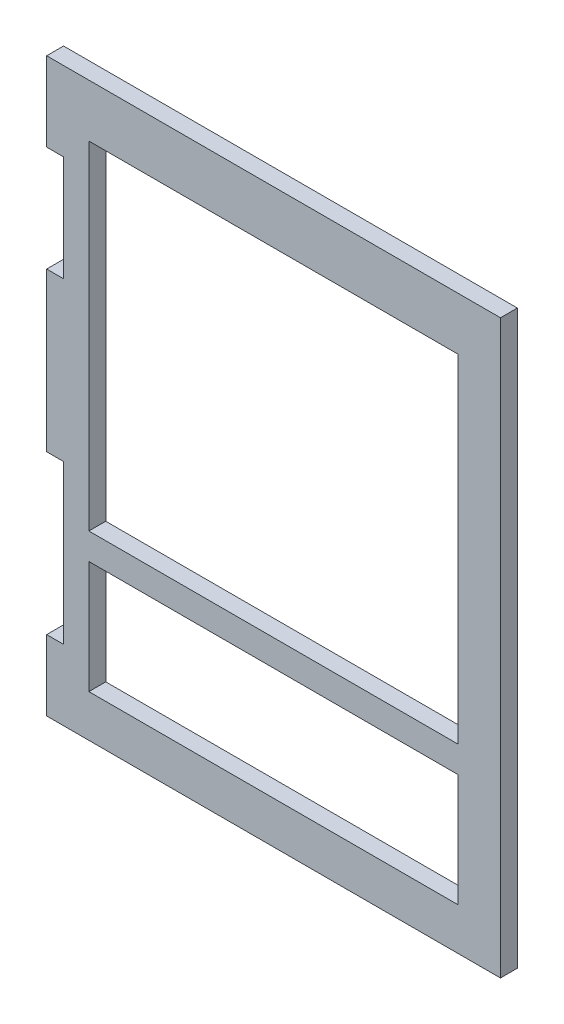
ISO-10303-21;
HEADER;
FILE_DESCRIPTION(('STEP AP214'),'2;1');
FILE_NAME('part.step','',(''),(''),'','','');
FILE_SCHEMA(('AUTOMOTIVE_DESIGN { 1 0 10303 214 1 1 1 1 }'));
ENDSEC;
DATA;
#1=APPLICATION_CONTEXT('core data for automotive mechanical design processes');
#2=APPLICATION_PROTOCOL_DEFINITION('international standard','automotive_design',2000,#1);
#3=PRODUCT_CONTEXT('',#1,'mechanical');
#4=PRODUCT('Part','Part','',(#3));
#5=PRODUCT_RELATED_PRODUCT_CATEGORY('part','',(#4));
#6=PRODUCT_DEFINITION_FORMATION('','',#4);
#7=PRODUCT_DEFINITION_CONTEXT('part definition',#1,'design');
#8=PRODUCT_DEFINITION('design','',#6,#7);
#9=PRODUCT_DEFINITION_SHAPE('','',#8);
#10=(LENGTH_UNIT() NAMED_UNIT(*) SI_UNIT(.MILLI.,.METRE.));
#11=(NAMED_UNIT(*) PLANE_ANGLE_UNIT() SI_UNIT($,.RADIAN.));
#12=(NAMED_UNIT(*) SI_UNIT($,.STERADIAN.) SOLID_ANGLE_UNIT());
#13=UNCERTAINTY_MEASURE_WITH_UNIT(LENGTH_MEASURE(1.E-05),#10,'distance_accuracy_value','');
#14=(GEOMETRIC_REPRESENTATION_CONTEXT(3) GLOBAL_UNCERTAINTY_ASSIGNED_CONTEXT((#13)) GLOBAL_UNIT_ASSIGNED_CONTEXT((#10,
#11,#12)) REPRESENTATION_CONTEXT('',''));
#15=CARTESIAN_POINT('',(0.,0.,0.));
#16=DIRECTION('',(0.,0.,1.));
#17=DIRECTION('',(1.,0.,0.));
#18=AXIS2_PLACEMENT_3D('',#15,#16,#17);
#19=CARTESIAN_POINT('',(0.,223.,16.));
#20=DIRECTION('',(0.,1.,0.));
#21=DIRECTION('',(0.,0.,1.));
#22=AXIS2_PLACEMENT_3D('',#19,#20,#21);
#23=PLANE('',#22);
#24=DIRECTION('',(1.,0.,0.));
#25=VECTOR('',#24,1.);
#26=CARTESIAN_POINT('',(0.,223.,0.));
#27=LINE('',#26,#25);
#28=CARTESIAN_POINT('',(40.,223.,0.));
#29=VERTEX_POINT('',#28);
#30=CARTESIAN_POINT('',(390.,223.,0.));
#31=VERTEX_POINT('',#30);
#32=EDGE_CURVE('E247',#29,#31,#27,.T.);
#33=ORIENTED_EDGE('',*,*,#32,.T.);
#34=DIRECTION('',(0.,0.,-1.));
#35=VECTOR('',#34,1.);
#36=CARTESIAN_POINT('',(390.,223.,16.));
#37=LINE('',#36,#35);
#38=CARTESIAN_POINT('',(390.,223.,16.));
#39=VERTEX_POINT('',#38);
#40=EDGE_CURVE('E11',#39,#31,#37,.T.);
#41=ORIENTED_EDGE('',*,*,#40,.F.);
#42=DIRECTION('',(1.,0.,0.));
#43=VECTOR('',#42,1.);
#44=CARTESIAN_POINT('',(0.,223.,16.));
#45=LINE('',#44,#43);
#46=CARTESIAN_POINT('',(40.,223.,16.));
#47=VERTEX_POINT('',#46);
#48=EDGE_CURVE('E187',#47,#39,#45,.T.);
#49=ORIENTED_EDGE('',*,*,#48,.F.);
#50=DIRECTION('',(0.,0.,-1.));
#51=VECTOR('',#50,1.);
#52=CARTESIAN_POINT('',(40.,223.,16.));
#53=LINE('',#52,#51);
#54=EDGE_CURVE('E54',#47,#29,#53,.T.);
#55=ORIENTED_EDGE('',*,*,#54,.T.);
#56=EDGE_LOOP('',(#33,#41,#49,#55));
#57=FACE_BOUND('',#56,.T.);
#58=ADVANCED_FACE('F35',(#57),#23,.F.);
#59=CARTESIAN_POINT('',(390.,0.,16.));
#60=DIRECTION('',(1.,0.,0.));
#61=DIRECTION('',(0.,0.,-1.));
#62=AXIS2_PLACEMENT_3D('',#59,#60,#61);
#63=PLANE('',#62);
#64=DIRECTION('',(0.,-1.,0.));
#65=VECTOR('',#64,1.);
#66=CARTESIAN_POINT('',(390.,0.,0.));
#67=LINE('',#66,#65);
#68=CARTESIAN_POINT('',(390.,116.2,0.));
#69=VERTEX_POINT('',#68);
#70=EDGE_CURVE('E193',#31,#69,#67,.T.);
#71=ORIENTED_EDGE('',*,*,#70,.T.);
#72=DIRECTION('',(0.,0.,-1.));
#73=VECTOR('',#72,1.);
#74=CARTESIAN_POINT('',(390.,116.2,16.));
#75=LINE('',#74,#73);
#76=CARTESIAN_POINT('',(390.,116.2,16.));
#77=VERTEX_POINT('',#76);
#78=EDGE_CURVE('E45',#77,#69,#75,.T.);
#79=ORIENTED_EDGE('',*,*,#78,.F.);
#80=DIRECTION('',(0.,-1.,0.));
#81=VECTOR('',#80,1.);
#82=CARTESIAN_POINT('',(390.,0.,16.));
#83=LINE('',#82,#81);
#84=EDGE_CURVE('E181',#39,#77,#83,.T.);
#85=ORIENTED_EDGE('',*,*,#84,.F.);
#86=ORIENTED_EDGE('',*,*,#40,.T.);
#87=EDGE_LOOP('',(#71,#79,#85,#86));
#88=FACE_BOUND('',#87,.T.);
#89=ADVANCED_FACE('F192',(#88),#63,.F.);
#90=CARTESIAN_POINT('',(0.,116.2,16.));
#91=DIRECTION('',(0.,1.,0.));
#92=DIRECTION('',(0.,0.,1.));
#93=AXIS2_PLACEMENT_3D('',#90,#91,#92);
#94=PLANE('',#93);
#95=DIRECTION('',(1.,0.,0.));
#96=VECTOR('',#95,1.);
#97=CARTESIAN_POINT('',(0.,116.2,0.));
#98=LINE('',#97,#96);
#99=CARTESIAN_POINT('',(40.,116.2,0.));
#100=VERTEX_POINT('',#99);
#101=EDGE_CURVE('E250',#100,#69,#98,.T.);
#102=ORIENTED_EDGE('',*,*,#101,.F.);
#103=DIRECTION('',(0.,0.,-1.));
#104=VECTOR('',#103,1.);
#105=CARTESIAN_POINT('',(40.,116.2,16.));
#106=LINE('',#105,#104);
#107=CARTESIAN_POINT('',(40.,116.2,16.));
#108=VERTEX_POINT('',#107);
#109=EDGE_CURVE('E116',#108,#100,#106,.T.);
#110=ORIENTED_EDGE('',*,*,#109,.F.);
#111=DIRECTION('',(1.,0.,0.));
#112=VECTOR('',#111,1.);
#113=CARTESIAN_POINT('',(0.,116.2,16.));
#114=LINE('',#113,#112);
#115=EDGE_CURVE('E186',#108,#77,#114,.T.);
#116=ORIENTED_EDGE('',*,*,#115,.T.);
#117=ORIENTED_EDGE('',*,*,#78,.T.);
#118=EDGE_LOOP('',(#102,#110,#116,#117));
#119=FACE_BOUND('',#118,.T.);
#120=ADVANCED_FACE('F197',(#119),#94,.T.);
#121=CARTESIAN_POINT('',(0.,293.,16.));
#122=DIRECTION('',(0.,1.,0.));
#123=DIRECTION('',(0.,0.,1.));
#124=AXIS2_PLACEMENT_3D('',#121,#122,#123);
#125=PLANE('',#124);
#126=DIRECTION('',(1.,0.,0.));
#127=VECTOR('',#126,1.);
#128=CARTESIAN_POINT('',(0.,293.,0.));
#129=LINE('',#128,#127);
#130=CARTESIAN_POINT('',(0.,293.,0.));
#131=VERTEX_POINT('',#130);
#132=CARTESIAN_POINT('',(16.,293.,0.));
#133=VERTEX_POINT('',#132);
#134=EDGE_CURVE('E216',#131,#133,#129,.T.);
#135=ORIENTED_EDGE('',*,*,#134,.T.);
#136=DIRECTION('',(0.,0.,-1.));
#137=VECTOR('',#136,1.);
#138=CARTESIAN_POINT('',(16.,293.,16.));
#139=LINE('',#138,#137);
#140=CARTESIAN_POINT('',(16.,293.,16.));
#141=VERTEX_POINT('',#140);
#142=EDGE_CURVE('E257',#141,#133,#139,.T.);
#143=ORIENTED_EDGE('',*,*,#142,.F.);
#144=DIRECTION('',(1.,0.,0.));
#145=VECTOR('',#144,1.);
#146=CARTESIAN_POINT('',(0.,293.,16.));
#147=LINE('',#146,#145);
#148=CARTESIAN_POINT('',(0.,293.,16.));
#149=VERTEX_POINT('',#148);
#150=EDGE_CURVE('E514',#149,#141,#147,.T.);
#151=ORIENTED_EDGE('',*,*,#150,.F.);
#152=DIRECTION('',(0.,0.,-1.));
#153=VECTOR('',#152,1.);
#154=CARTESIAN_POINT('',(0.,293.,16.));
#155=LINE('',#154,#153);
#156=EDGE_CURVE('E259',#149,#131,#155,.T.);
#157=ORIENTED_EDGE('',*,*,#156,.T.);
#158=EDGE_LOOP('',(#135,#143,#151,#157));
#159=FACE_BOUND('',#158,.T.);
#160=ADVANCED_FACE('F357',(#159),#125,.F.);
#161=CARTESIAN_POINT('',(16.,0.,16.));
#162=DIRECTION('',(1.,0.,0.));
#163=DIRECTION('',(0.,1.,0.));
#164=AXIS2_PLACEMENT_3D('',#161,#162,#163);
#165=PLANE('',#164);
#166=DIRECTION('',(0.,-1.,0.));
#167=VECTOR('',#166,1.);
#168=CARTESIAN_POINT('',(16.,0.,0.));
#169=LINE('',#168,#167);
#170=CARTESIAN_POINT('',(16.,143.,0.));
#171=VERTEX_POINT('',#170);
#172=EDGE_CURVE('E219',#133,#171,#169,.T.);
#173=ORIENTED_EDGE('',*,*,#172,.T.);
#174=DIRECTION('',(0.,0.,-1.));
#175=VECTOR('',#174,1.);
#176=CARTESIAN_POINT('',(16.,143.,16.));
#177=LINE('',#176,#175);
#178=CARTESIAN_POINT('',(16.,143.,16.));
#179=VERTEX_POINT('',#178);
#180=EDGE_CURVE('E280',#179,#171,#177,.T.);
#181=ORIENTED_EDGE('',*,*,#180,.F.);
#182=DIRECTION('',(0.,-1.,0.));
#183=VECTOR('',#182,1.);
#184=CARTESIAN_POINT('',(16.,0.,16.));
#185=LINE('',#184,#183);
#186=EDGE_CURVE('E513',#141,#179,#185,.T.);
#187=ORIENTED_EDGE('',*,*,#186,.F.);
#188=ORIENTED_EDGE('',*,*,#142,.T.);
#189=EDGE_LOOP('',(#173,#181,#187,#188));
#190=FACE_BOUND('',#189,.T.);
#191=ADVANCED_FACE('F353',(#190),#165,.F.);
#192=CARTESIAN_POINT('',(0.,143.,16.));
#193=DIRECTION('',(0.,1.,0.));
#194=DIRECTION('',(0.,0.,1.));
#195=AXIS2_PLACEMENT_3D('',#192,#193,#194);
#196=PLANE('',#195);
#197=DIRECTION('',(1.,0.,0.));
#198=VECTOR('',#197,1.);
#199=CARTESIAN_POINT('',(0.,143.,0.));
#200=LINE('',#199,#198);
#201=CARTESIAN_POINT('',(0.,143.,0.));
#202=VERTEX_POINT('',#201);
#203=EDGE_CURVE('E222',#202,#171,#200,.T.);
#204=ORIENTED_EDGE('',*,*,#203,.F.);
#205=DIRECTION('',(0.,0.,-1.));
#206=VECTOR('',#205,1.);
#207=CARTESIAN_POINT('',(0.,143.,16.));
#208=LINE('',#207,#206);
#209=CARTESIAN_POINT('',(0.,143.,16.));
#210=VERTEX_POINT('',#209);
#211=EDGE_CURVE('E278',#210,#202,#208,.T.);
#212=ORIENTED_EDGE('',*,*,#211,.F.);
#213=DIRECTION('',(1.,0.,0.));
#214=VECTOR('',#213,1.);
#215=CARTESIAN_POINT('',(0.,143.,16.));
#216=LINE('',#215,#214);
#217=EDGE_CURVE('E496',#210,#179,#216,.T.);
#218=ORIENTED_EDGE('',*,*,#217,.T.);
#219=ORIENTED_EDGE('',*,*,#180,.T.);
#220=EDGE_LOOP('',(#204,#212,#218,#219));
#221=FACE_BOUND('',#220,.T.);
#222=ADVANCED_FACE('F350',(#221),#196,.T.);
#223=CARTESIAN_POINT('',(0.,0.,16.));
#224=DIRECTION('',(-1.,0.,0.));
#225=DIRECTION('',(0.,0.,1.));
#226=AXIS2_PLACEMENT_3D('',#223,#224,#225);
#227=PLANE('',#226);
#228=DIRECTION('',(0.,1.,0.));
#229=VECTOR('',#228,1.);
#230=CARTESIAN_POINT('',(0.,0.,0.));
#231=LINE('',#230,#229);
#232=CARTESIAN_POINT('',(0.,76.2,0.));
#233=VERTEX_POINT('',#232);
#234=EDGE_CURVE('E225',#233,#202,#231,.T.);
#235=ORIENTED_EDGE('',*,*,#234,.F.);
#236=DIRECTION('',(0.,0.,-1.));
#237=VECTOR('',#236,1.);
#238=CARTESIAN_POINT('',(0.,76.2,16.));
#239=LINE('',#238,#237);
#240=CARTESIAN_POINT('',(0.,76.2,16.));
#241=VERTEX_POINT('',#240);
#242=EDGE_CURVE('E276',#241,#233,#239,.T.);
#243=ORIENTED_EDGE('',*,*,#242,.F.);
#244=DIRECTION('',(0.,1.,0.));
#245=VECTOR('',#244,1.);
#246=CARTESIAN_POINT('',(0.,0.,16.));
#247=LINE('',#246,#245);
#248=EDGE_CURVE('E489',#241,#210,#247,.T.);
#249=ORIENTED_EDGE('',*,*,#248,.T.);
#250=ORIENTED_EDGE('',*,*,#211,.T.);
#251=EDGE_LOOP('',(#235,#243,#249,#250));
#252=FACE_BOUND('',#251,.T.);
#253=ADVANCED_FACE('F315',(#252),#227,.T.);
#254=CARTESIAN_POINT('',(0.,76.2,16.));
#255=DIRECTION('',(0.,-1.,0.));
#256=DIRECTION('',(1.,0.,0.));
#257=AXIS2_PLACEMENT_3D('',#254,#255,#256);
#258=PLANE('',#257);
#259=DIRECTION('',(-1.,0.,0.));
#260=VECTOR('',#259,1.);
#261=CARTESIAN_POINT('',(0.,76.2,0.));
#262=LINE('',#261,#260);
#263=CARTESIAN_POINT('',(430.,76.2,0.));
#264=VERTEX_POINT('',#263);
#265=EDGE_CURVE('E228',#264,#233,#262,.T.);
#266=ORIENTED_EDGE('',*,*,#265,.F.);
#267=DIRECTION('',(0.,0.,-1.));
#268=VECTOR('',#267,1.);
#269=CARTESIAN_POINT('',(430.,76.2,16.));
#270=LINE('',#269,#268);
#271=CARTESIAN_POINT('',(430.,76.2,16.));
#272=VERTEX_POINT('',#271);
#273=EDGE_CURVE('E274',#272,#264,#270,.T.);
#274=ORIENTED_EDGE('',*,*,#273,.F.);
#275=DIRECTION('',(-1.,0.,0.));
#276=VECTOR('',#275,1.);
#277=CARTESIAN_POINT('',(0.,76.2,16.));
#278=LINE('',#277,#276);
#279=EDGE_CURVE('E495',#272,#241,#278,.T.);
#280=ORIENTED_EDGE('',*,*,#279,.T.);
#281=ORIENTED_EDGE('',*,*,#242,.T.);
#282=EDGE_LOOP('',(#266,#274,#280,#281));
#283=FACE_BOUND('',#282,.T.);
#284=ADVANCED_FACE('F345',(#283),#258,.T.);
#285=CARTESIAN_POINT('',(430.,1.11022302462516E-13,16.));
#286=DIRECTION('',(-1.,0.,0.));
#287=DIRECTION('',(0.,-1.,0.));
#288=AXIS2_PLACEMENT_3D('',#285,#286,#287);
#289=PLANE('',#288);
#290=DIRECTION('',(0.,1.,0.));
#291=VECTOR('',#290,1.);
#292=CARTESIAN_POINT('',(430.,1.11022302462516E-13,0.));
#293=LINE('',#292,#291);
#294=CARTESIAN_POINT('',(430.,618.,0.));
#295=VERTEX_POINT('',#294);
#296=EDGE_CURVE('E233',#264,#295,#293,.T.);
#297=ORIENTED_EDGE('',*,*,#296,.T.);
#298=DIRECTION('',(0.,0.,-1.));
#299=VECTOR('',#298,1.);
#300=CARTESIAN_POINT('',(430.,618.,16.));
#301=LINE('',#300,#299);
#302=CARTESIAN_POINT('',(430.,618.,16.));
#303=VERTEX_POINT('',#302);
#304=EDGE_CURVE('E272',#303,#295,#301,.T.);
#305=ORIENTED_EDGE('',*,*,#304,.F.);
#306=DIRECTION('',(0.,1.,0.));
#307=VECTOR('',#306,1.);
#308=CARTESIAN_POINT('',(430.,1.11022302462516E-13,16.));
#309=LINE('',#308,#307);
#310=EDGE_CURVE('E490',#272,#303,#309,.T.);
#311=ORIENTED_EDGE('',*,*,#310,.F.);
#312=ORIENTED_EDGE('',*,*,#273,.T.);
#313=EDGE_LOOP('',(#297,#305,#311,#312));
#314=FACE_BOUND('',#313,.T.);
#315=ADVANCED_FACE('F341',(#314),#289,.F.);
#316=CARTESIAN_POINT('',(0.,618.,16.));
#317=DIRECTION('',(0.,1.,0.));
#318=DIRECTION('',(0.,0.,1.));
#319=AXIS2_PLACEMENT_3D('',#316,#317,#318);
#320=PLANE('',#319);
#321=DIRECTION('',(1.,0.,0.));
#322=VECTOR('',#321,1.);
#323=CARTESIAN_POINT('',(0.,618.,0.));
#324=LINE('',#323,#322);
#325=CARTESIAN_POINT('',(0.,618.,0.));
#326=VERTEX_POINT('',#325);
#327=EDGE_CURVE('E236',#326,#295,#324,.T.);
#328=ORIENTED_EDGE('',*,*,#327,.F.);
#329=DIRECTION('',(0.,0.,-1.));
#330=VECTOR('',#329,1.);
#331=CARTESIAN_POINT('',(0.,618.,16.));
#332=LINE('',#331,#330);
#333=CARTESIAN_POINT('',(0.,618.,16.));
#334=VERTEX_POINT('',#333);
#335=EDGE_CURVE('E270',#334,#326,#332,.T.);
#336=ORIENTED_EDGE('',*,*,#335,.F.);
#337=DIRECTION('',(1.,0.,0.));
#338=VECTOR('',#337,1.);
#339=CARTESIAN_POINT('',(0.,618.,16.));
#340=LINE('',#339,#338);
#341=EDGE_CURVE('E487',#334,#303,#340,.T.);
#342=ORIENTED_EDGE('',*,*,#341,.T.);
#343=ORIENTED_EDGE('',*,*,#304,.T.);
#344=EDGE_LOOP('',(#328,#336,#342,#343));
#345=FACE_BOUND('',#344,.T.);
#346=ADVANCED_FACE('F338',(#345),#320,.T.);
#347=CARTESIAN_POINT('',(0.,543.,0.));
#348=VERTEX_POINT('',#347);
#349=EDGE_CURVE('E230',#348,#326,#231,.T.);
#350=ORIENTED_EDGE('',*,*,#349,.F.);
#351=DIRECTION('',(0.,0.,-1.));
#352=VECTOR('',#351,1.);
#353=CARTESIAN_POINT('',(0.,543.,16.));
#354=LINE('',#353,#352);
#355=CARTESIAN_POINT('',(0.,543.,16.));
#356=VERTEX_POINT('',#355);
#357=EDGE_CURVE('E268',#356,#348,#354,.T.);
#358=ORIENTED_EDGE('',*,*,#357,.F.);
#359=EDGE_CURVE('E482',#356,#334,#247,.T.);
#360=ORIENTED_EDGE('',*,*,#359,.T.);
#361=ORIENTED_EDGE('',*,*,#335,.T.);
#362=EDGE_LOOP('',(#350,#358,#360,#361));
#363=FACE_BOUND('',#362,.T.);
#364=ADVANCED_FACE('F316',(#363),#227,.T.);
#365=CARTESIAN_POINT('',(0.,543.,16.));
#366=DIRECTION('',(0.,1.,0.));
#367=DIRECTION('',(0.,0.,1.));
#368=AXIS2_PLACEMENT_3D('',#365,#366,#367);
#369=PLANE('',#368);
#370=DIRECTION('',(1.,0.,0.));
#371=VECTOR('',#370,1.);
#372=CARTESIAN_POINT('',(0.,543.,0.));
#373=LINE('',#372,#371);
#374=CARTESIAN_POINT('',(16.,543.,0.));
#375=VERTEX_POINT('',#374);
#376=EDGE_CURVE('E239',#348,#375,#373,.T.);
#377=ORIENTED_EDGE('',*,*,#376,.T.);
#378=DIRECTION('',(0.,0.,-1.));
#379=VECTOR('',#378,1.);
#380=CARTESIAN_POINT('',(16.,543.,16.));
#381=LINE('',#380,#379);
#382=CARTESIAN_POINT('',(16.,543.,16.));
#383=VERTEX_POINT('',#382);
#384=EDGE_CURVE('E265',#383,#375,#381,.T.);
#385=ORIENTED_EDGE('',*,*,#384,.F.);
#386=DIRECTION('',(1.,0.,0.));
#387=VECTOR('',#386,1.);
#388=CARTESIAN_POINT('',(0.,543.,16.));
#389=LINE('',#388,#387);
#390=EDGE_CURVE('E478',#356,#383,#389,.T.);
#391=ORIENTED_EDGE('',*,*,#390,.F.);
#392=ORIENTED_EDGE('',*,*,#357,.T.);
#393=EDGE_LOOP('',(#377,#385,#391,#392));
#394=FACE_BOUND('',#393,.T.);
#395=ADVANCED_FACE('F333',(#394),#369,.F.);
#396=CARTESIAN_POINT('',(16.0000000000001,0.,16.));
#397=DIRECTION('',(1.,0.,0.));
#398=DIRECTION('',(0.,1.,0.));
#399=AXIS2_PLACEMENT_3D('',#396,#397,#398);
#400=PLANE('',#399);
#401=DIRECTION('',(0.,-1.,0.));
#402=VECTOR('',#401,1.);
#403=CARTESIAN_POINT('',(16.0000000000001,0.,0.));
#404=LINE('',#403,#402);
#405=CARTESIAN_POINT('',(16.,443.,0.));
#406=VERTEX_POINT('',#405);
#407=EDGE_CURVE('E241',#375,#406,#404,.T.);
#408=ORIENTED_EDGE('',*,*,#407,.T.);
#409=DIRECTION('',(0.,0.,-1.));
#410=VECTOR('',#409,1.);
#411=CARTESIAN_POINT('',(16.,443.,16.));
#412=LINE('',#411,#410);
#413=CARTESIAN_POINT('',(16.,443.,16.));
#414=VERTEX_POINT('',#413);
#415=EDGE_CURVE('E263',#414,#406,#412,.T.);
#416=ORIENTED_EDGE('',*,*,#415,.F.);
#417=DIRECTION('',(0.,-1.,0.));
#418=VECTOR('',#417,1.);
#419=CARTESIAN_POINT('',(16.0000000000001,0.,16.));
#420=LINE('',#419,#418);
#421=EDGE_CURVE('E481',#383,#414,#420,.T.);
#422=ORIENTED_EDGE('',*,*,#421,.F.);
#423=ORIENTED_EDGE('',*,*,#384,.T.);
#424=EDGE_LOOP('',(#408,#416,#422,#423));
#425=FACE_BOUND('',#424,.T.);
#426=ADVANCED_FACE('F329',(#425),#400,.F.);
#427=CARTESIAN_POINT('',(0.,443.,16.));
#428=DIRECTION('',(0.,1.,0.));
#429=DIRECTION('',(0.,0.,1.));
#430=AXIS2_PLACEMENT_3D('',#427,#428,#429);
#431=PLANE('',#430);
#432=DIRECTION('',(1.,0.,0.));
#433=VECTOR('',#432,1.);
#434=CARTESIAN_POINT('',(0.,443.,0.));
#435=LINE('',#434,#433);
#436=CARTESIAN_POINT('',(0.,443.,0.));
#437=VERTEX_POINT('',#436);
#438=EDGE_CURVE('E244',#437,#406,#435,.T.);
#439=ORIENTED_EDGE('',*,*,#438,.F.);
#440=DIRECTION('',(0.,0.,-1.));
#441=VECTOR('',#440,1.);
#442=CARTESIAN_POINT('',(0.,443.,16.));
#443=LINE('',#442,#441);
#444=CARTESIAN_POINT('',(0.,443.,16.));
#445=VERTEX_POINT('',#444);
#446=EDGE_CURVE('E261',#445,#437,#443,.T.);
#447=ORIENTED_EDGE('',*,*,#446,.F.);
#448=DIRECTION('',(1.,0.,0.));
#449=VECTOR('',#448,1.);
#450=CARTESIAN_POINT('',(0.,443.,16.));
#451=LINE('',#450,#449);
#452=EDGE_CURVE('E475',#445,#414,#451,.T.);
#453=ORIENTED_EDGE('',*,*,#452,.T.);
#454=ORIENTED_EDGE('',*,*,#415,.T.);
#455=EDGE_LOOP('',(#439,#447,#453,#454));
#456=FACE_BOUND('',#455,.T.);
#457=ADVANCED_FACE('F326',(#456),#431,.T.);
#458=CARTESIAN_POINT('',(0.,568.,16.));
#459=DIRECTION('',(0.,1.,0.));
#460=DIRECTION('',(0.,0.,1.));
#461=AXIS2_PLACEMENT_3D('',#458,#459,#460);
#462=PLANE('',#461);
#463=DIRECTION('',(1.,0.,0.));
#464=VECTOR('',#463,1.);
#465=CARTESIAN_POINT('',(0.,568.,0.));
#466=LINE('',#465,#464);
#467=CARTESIAN_POINT('',(40.,568.,0.));
#468=VERTEX_POINT('',#467);
#469=CARTESIAN_POINT('',(390.,568.,0.));
#470=VERTEX_POINT('',#469);
#471=EDGE_CURVE('E204',#468,#470,#466,.T.);
#472=ORIENTED_EDGE('',*,*,#471,.T.);
#473=DIRECTION('',(0.,0.,-1.));
#474=VECTOR('',#473,1.);
#475=CARTESIAN_POINT('',(390.,568.,16.));
#476=LINE('',#475,#474);
#477=CARTESIAN_POINT('',(390.,568.,16.));
#478=VERTEX_POINT('',#477);
#479=EDGE_CURVE('E39',#478,#470,#476,.T.);
#480=ORIENTED_EDGE('',*,*,#479,.F.);
#481=DIRECTION('',(1.,0.,0.));
#482=VECTOR('',#481,1.);
#483=CARTESIAN_POINT('',(0.,568.,16.));
#484=LINE('',#483,#482);
#485=CARTESIAN_POINT('',(40.,568.,16.));
#486=VERTEX_POINT('',#485);
#487=EDGE_CURVE('E255',#486,#478,#484,.T.);
#488=ORIENTED_EDGE('',*,*,#487,.F.);
#489=DIRECTION('',(0.,0.,-1.));
#490=VECTOR('',#489,1.);
#491=CARTESIAN_POINT('',(40.,568.,16.));
#492=LINE('',#491,#490);
#493=EDGE_CURVE('E200',#486,#468,#492,.T.);
#494=ORIENTED_EDGE('',*,*,#493,.T.);
#495=EDGE_LOOP('',(#472,#480,#488,#494));
#496=FACE_BOUND('',#495,.T.);
#497=ADVANCED_FACE('F37',(#496),#462,.F.);
#498=CARTESIAN_POINT('',(390.,0.,16.));
#499=DIRECTION('',(1.,0.,0.));
#500=DIRECTION('',(0.,1.,0.));
#501=AXIS2_PLACEMENT_3D('',#498,#499,#500);
#502=PLANE('',#501);
#503=DIRECTION('',(0.,-1.,0.));
#504=VECTOR('',#503,1.);
#505=CARTESIAN_POINT('',(390.,0.,0.));
#506=LINE('',#505,#504);
#507=CARTESIAN_POINT('',(390.,248.,0.));
#508=VERTEX_POINT('',#507);
#509=EDGE_CURVE('E207',#470,#508,#506,.T.);
#510=ORIENTED_EDGE('',*,*,#509,.T.);
#511=DIRECTION('',(0.,0.,-1.));
#512=VECTOR('',#511,1.);
#513=CARTESIAN_POINT('',(390.,248.,16.));
#514=LINE('',#513,#512);
#515=CARTESIAN_POINT('',(390.,248.,16.));
#516=VERTEX_POINT('',#515);
#517=EDGE_CURVE('E286',#516,#508,#514,.T.);
#518=ORIENTED_EDGE('',*,*,#517,.F.);
#519=DIRECTION('',(0.,-1.,0.));
#520=VECTOR('',#519,1.);
#521=CARTESIAN_POINT('',(390.,0.,16.));
#522=LINE('',#521,#520);
#523=EDGE_CURVE('E129',#478,#516,#522,.T.);
#524=ORIENTED_EDGE('',*,*,#523,.F.);
#525=ORIENTED_EDGE('',*,*,#479,.T.);
#526=EDGE_LOOP('',(#510,#518,#524,#525));
#527=FACE_BOUND('',#526,.T.);
#528=ADVANCED_FACE('F291',(#527),#502,.F.);
#529=CARTESIAN_POINT('',(0.,248.,16.));
#530=DIRECTION('',(0.,1.,0.));
#531=DIRECTION('',(0.,0.,1.));
#532=AXIS2_PLACEMENT_3D('',#529,#530,#531);
#533=PLANE('',#532);
#534=DIRECTION('',(1.,0.,0.));
#535=VECTOR('',#534,1.);
#536=CARTESIAN_POINT('',(0.,248.,0.));
#537=LINE('',#536,#535);
#538=CARTESIAN_POINT('',(40.,248.,0.));
#539=VERTEX_POINT('',#538);
#540=EDGE_CURVE('E210',#539,#508,#537,.T.);
#541=ORIENTED_EDGE('',*,*,#540,.F.);
#542=DIRECTION('',(0.,0.,-1.));
#543=VECTOR('',#542,1.);
#544=CARTESIAN_POINT('',(40.,248.,16.));
#545=LINE('',#544,#543);
#546=CARTESIAN_POINT('',(40.,248.,16.));
#547=VERTEX_POINT('',#546);
#548=EDGE_CURVE('E285',#547,#539,#545,.T.);
#549=ORIENTED_EDGE('',*,*,#548,.F.);
#550=DIRECTION('',(1.,0.,0.));
#551=VECTOR('',#550,1.);
#552=CARTESIAN_POINT('',(0.,248.,16.));
#553=LINE('',#552,#551);
#554=EDGE_CURVE('E517',#547,#516,#553,.T.);
#555=ORIENTED_EDGE('',*,*,#554,.T.);
#556=ORIENTED_EDGE('',*,*,#517,.T.);
#557=EDGE_LOOP('',(#541,#549,#555,#556));
#558=FACE_BOUND('',#557,.T.);
#559=ADVANCED_FACE('F305',(#558),#533,.T.);
#560=EDGE_CURVE('E229',#131,#437,#231,.T.);
#561=ORIENTED_EDGE('',*,*,#560,.F.);
#562=ORIENTED_EDGE('',*,*,#156,.F.);
#563=EDGE_CURVE('E471',#149,#445,#247,.T.);
#564=ORIENTED_EDGE('',*,*,#563,.T.);
#565=ORIENTED_EDGE('',*,*,#446,.T.);
#566=EDGE_LOOP('',(#561,#562,#564,#565));
#567=FACE_BOUND('',#566,.T.);
#568=ADVANCED_FACE('F307',(#567),#227,.T.);
#569=CARTESIAN_POINT('',(40.0000000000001,0.,16.));
#570=DIRECTION('',(1.,0.,0.));
#571=DIRECTION('',(0.,1.,0.));
#572=AXIS2_PLACEMENT_3D('',#569,#570,#571);
#573=PLANE('',#572);
#574=DIRECTION('',(0.,-1.,0.));
#575=VECTOR('',#574,1.);
#576=CARTESIAN_POINT('',(40.0000000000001,0.,0.));
#577=LINE('',#576,#575);
#578=EDGE_CURVE('E213',#468,#539,#577,.T.);
#579=ORIENTED_EDGE('',*,*,#578,.F.);
#580=ORIENTED_EDGE('',*,*,#493,.F.);
#581=DIRECTION('',(0.,-1.,0.));
#582=VECTOR('',#581,1.);
#583=CARTESIAN_POINT('',(40.0000000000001,0.,16.));
#584=LINE('',#583,#582);
#585=EDGE_CURVE('E303',#486,#547,#584,.T.);
#586=ORIENTED_EDGE('',*,*,#585,.T.);
#587=ORIENTED_EDGE('',*,*,#548,.T.);
#588=EDGE_LOOP('',(#579,#580,#586,#587));
#589=FACE_BOUND('',#588,.T.);
#590=ADVANCED_FACE('F300',(#589),#573,.T.);
#591=CARTESIAN_POINT('',(40.,0.,16.));
#592=DIRECTION('',(1.,0.,0.));
#593=DIRECTION('',(0.,0.,-1.));
#594=AXIS2_PLACEMENT_3D('',#591,#592,#593);
#595=PLANE('',#594);
#596=DIRECTION('',(0.,-1.,0.));
#597=VECTOR('',#596,1.);
#598=CARTESIAN_POINT('',(40.,0.,0.));
#599=LINE('',#598,#597);
#600=EDGE_CURVE('E252',#29,#100,#599,.T.);
#601=ORIENTED_EDGE('',*,*,#600,.F.);
#602=ORIENTED_EDGE('',*,*,#54,.F.);
#603=DIRECTION('',(0.,-1.,0.));
#604=VECTOR('',#603,1.);
#605=CARTESIAN_POINT('',(40.,0.,16.));
#606=LINE('',#605,#604);
#607=EDGE_CURVE('E198',#47,#108,#606,.T.);
#608=ORIENTED_EDGE('',*,*,#607,.T.);
#609=ORIENTED_EDGE('',*,*,#109,.T.);
#610=EDGE_LOOP('',(#601,#602,#608,#609));
#611=FACE_BOUND('',#610,.T.);
#612=ADVANCED_FACE('F362',(#611),#595,.T.);
#613=CARTESIAN_POINT('',(0.,0.,16.));
#614=DIRECTION('',(0.,0.,1.));
#615=DIRECTION('',(1.,0.,0.));
#616=AXIS2_PLACEMENT_3D('',#613,#614,#615);
#617=PLANE('',#616);
#618=ORIENTED_EDGE('',*,*,#487,.T.);
#619=ORIENTED_EDGE('',*,*,#523,.T.);
#620=ORIENTED_EDGE('',*,*,#554,.F.);
#621=ORIENTED_EDGE('',*,*,#585,.F.);
#622=EDGE_LOOP('',(#618,#619,#620,#621));
#623=FACE_BOUND('',#622,.T.);
#624=ORIENTED_EDGE('',*,*,#150,.T.);
#625=ORIENTED_EDGE('',*,*,#186,.T.);
#626=ORIENTED_EDGE('',*,*,#217,.F.);
#627=ORIENTED_EDGE('',*,*,#248,.F.);
#628=ORIENTED_EDGE('',*,*,#279,.F.);
#629=ORIENTED_EDGE('',*,*,#310,.T.);
#630=ORIENTED_EDGE('',*,*,#341,.F.);
#631=ORIENTED_EDGE('',*,*,#359,.F.);
#632=ORIENTED_EDGE('',*,*,#390,.T.);
#633=ORIENTED_EDGE('',*,*,#421,.T.);
#634=ORIENTED_EDGE('',*,*,#452,.F.);
#635=ORIENTED_EDGE('',*,*,#563,.F.);
#636=EDGE_LOOP('',(#624,#625,#626,#627,#628,#629,#630,#631,#632,#633,#634,#635));
#637=FACE_BOUND('',#636,.T.);
#638=ORIENTED_EDGE('',*,*,#48,.T.);
#639=ORIENTED_EDGE('',*,*,#84,.T.);
#640=ORIENTED_EDGE('',*,*,#115,.F.);
#641=ORIENTED_EDGE('',*,*,#607,.F.);
#642=EDGE_LOOP('',(#638,#639,#640,#641));
#643=FACE_BOUND('',#642,.T.);
#644=ADVANCED_FACE('F183',(#623,#637,#643),#617,.T.);
#645=CARTESIAN_POINT('',(0.,0.,0.));
#646=DIRECTION('',(0.,0.,1.));
#647=DIRECTION('',(1.,0.,0.));
#648=AXIS2_PLACEMENT_3D('',#645,#646,#647);
#649=PLANE('',#648);
#650=ORIENTED_EDGE('',*,*,#471,.F.);
#651=ORIENTED_EDGE('',*,*,#578,.T.);
#652=ORIENTED_EDGE('',*,*,#540,.T.);
#653=ORIENTED_EDGE('',*,*,#509,.F.);
#654=EDGE_LOOP('',(#650,#651,#652,#653));
#655=FACE_BOUND('',#654,.T.);
#656=ORIENTED_EDGE('',*,*,#134,.F.);
#657=ORIENTED_EDGE('',*,*,#560,.T.);
#658=ORIENTED_EDGE('',*,*,#438,.T.);
#659=ORIENTED_EDGE('',*,*,#407,.F.);
#660=ORIENTED_EDGE('',*,*,#376,.F.);
#661=ORIENTED_EDGE('',*,*,#349,.T.);
#662=ORIENTED_EDGE('',*,*,#327,.T.);
#663=ORIENTED_EDGE('',*,*,#296,.F.);
#664=ORIENTED_EDGE('',*,*,#265,.T.);
#665=ORIENTED_EDGE('',*,*,#234,.T.);
#666=ORIENTED_EDGE('',*,*,#203,.T.);
#667=ORIENTED_EDGE('',*,*,#172,.F.);
#668=EDGE_LOOP('',(#656,#657,#658,#659,#660,#661,#662,#663,#664,#665,#666,#667));
#669=FACE_BOUND('',#668,.T.);
#670=ORIENTED_EDGE('',*,*,#32,.F.);
#671=ORIENTED_EDGE('',*,*,#600,.T.);
#672=ORIENTED_EDGE('',*,*,#101,.T.);
#673=ORIENTED_EDGE('',*,*,#70,.F.);
#674=EDGE_LOOP('',(#670,#671,#672,#673));
#675=FACE_BOUND('',#674,.T.);
#676=ADVANCED_FACE('F297',(#655,#669,#675),#649,.F.);
#677=CLOSED_SHELL('',(#58,#89,#120,#160,#191,#222,#253,#284,#315,#346,#364,#395,#426,#457,#497,
#528,#559,#568,#590,#612,#644,#676));
#678=MANIFOLD_SOLID_BREP('B2',#677);
#679=ADVANCED_BREP_SHAPE_REPRESENTATION('',(#18,#678),#14);
#680=SHAPE_DEFINITION_REPRESENTATION(#9,#679);
ENDSEC;
END-ISO-10303-21;
